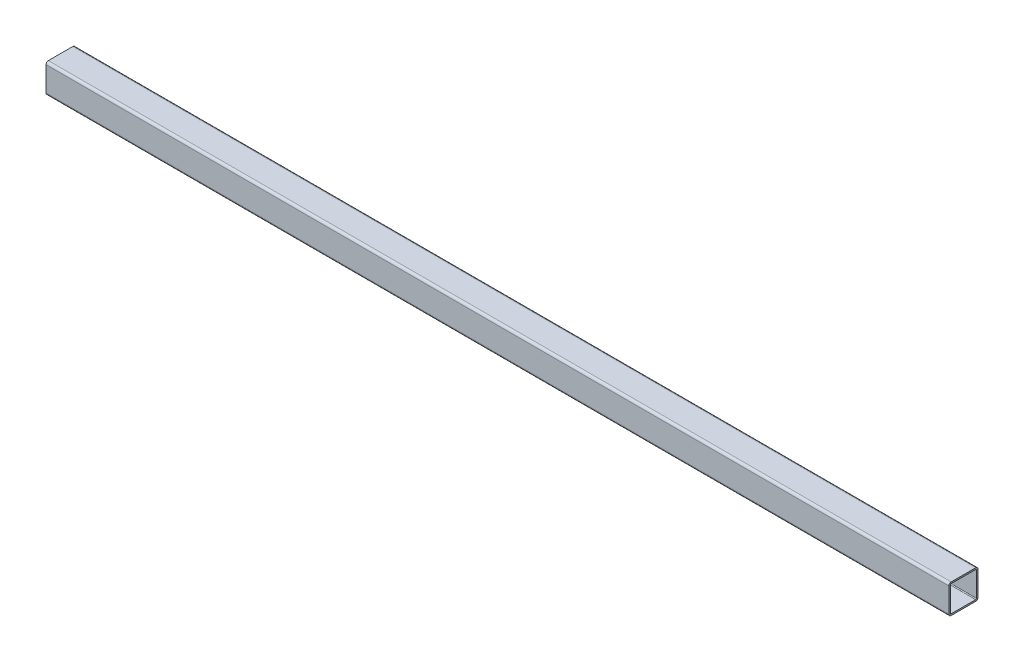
ISO-10303-21;
HEADER;
FILE_DESCRIPTION(('STEP AP214'),'2;1');
FILE_NAME('part.step','',(''),(''),'','','');
FILE_SCHEMA(('AUTOMOTIVE_DESIGN { 1 0 10303 214 1 1 1 1 }'));
ENDSEC;
DATA;
#1=APPLICATION_CONTEXT('core data for automotive mechanical design processes');
#2=APPLICATION_PROTOCOL_DEFINITION('international standard','automotive_design',2000,#1);
#3=PRODUCT_CONTEXT('',#1,'mechanical');
#4=PRODUCT('Part','Part','',(#3));
#5=PRODUCT_RELATED_PRODUCT_CATEGORY('part','',(#4));
#6=PRODUCT_DEFINITION_FORMATION('','',#4);
#7=PRODUCT_DEFINITION_CONTEXT('part definition',#1,'design');
#8=PRODUCT_DEFINITION('design','',#6,#7);
#9=PRODUCT_DEFINITION_SHAPE('','',#8);
#10=(LENGTH_UNIT() NAMED_UNIT(*) SI_UNIT(.MILLI.,.METRE.));
#11=(NAMED_UNIT(*) PLANE_ANGLE_UNIT() SI_UNIT($,.RADIAN.));
#12=(NAMED_UNIT(*) SI_UNIT($,.STERADIAN.) SOLID_ANGLE_UNIT());
#13=UNCERTAINTY_MEASURE_WITH_UNIT(LENGTH_MEASURE(1.E-05),#10,'distance_accuracy_value','');
#14=(GEOMETRIC_REPRESENTATION_CONTEXT(3) GLOBAL_UNCERTAINTY_ASSIGNED_CONTEXT((#13)) GLOBAL_UNIT_ASSIGNED_CONTEXT((#10,
#11,#12)) REPRESENTATION_CONTEXT('',''));
#15=CARTESIAN_POINT('',(0.,0.,0.));
#16=DIRECTION('',(0.,0.,1.));
#17=DIRECTION('',(1.,0.,0.));
#18=AXIS2_PLACEMENT_3D('',#15,#16,#17);
#19=CARTESIAN_POINT('',(393.7,10.541,21.209));
#20=DIRECTION('',(1.,0.,0.));
#21=DIRECTION('',(0.,0.,-1.));
#22=AXIS2_PLACEMENT_3D('',#19,#20,#21);
#23=PLANE('',#22);
#24=CARTESIAN_POINT('',(393.7,10.541,21.209));
#25=DIRECTION('',(1.,0.,0.));
#26=DIRECTION('',(0.,0.,-1.));
#27=AXIS2_PLACEMENT_3D('',#24,#25,#26);
#28=CIRCLE('',#27,1.01599999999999);
#29=CARTESIAN_POINT('',(393.7,10.541,22.225));
#30=VERTEX_POINT('',#29);
#31=CARTESIAN_POINT('',(393.7,9.525,21.209));
#32=VERTEX_POINT('',#31);
#33=EDGE_CURVE('E260',#30,#32,#28,.T.);
#34=ORIENTED_EDGE('',*,*,#33,.T.);
#35=DIRECTION('',(0.,0.,-1.));
#36=VECTOR('',#35,1.);
#37=CARTESIAN_POINT('',(393.7,9.525,21.209));
#38=LINE('',#37,#36);
#39=CARTESIAN_POINT('',(393.7,9.525,10.541));
#40=VERTEX_POINT('',#39);
#41=EDGE_CURVE('E474',#32,#40,#38,.T.);
#42=ORIENTED_EDGE('',*,*,#41,.T.);
#43=CARTESIAN_POINT('',(393.7,10.541,10.541));
#44=DIRECTION('',(1.,0.,0.));
#45=DIRECTION('',(0.,0.,-1.));
#46=AXIS2_PLACEMENT_3D('',#43,#44,#45);
#47=CIRCLE('',#46,1.016);
#48=CARTESIAN_POINT('',(393.7,10.541,9.525));
#49=VERTEX_POINT('',#48);
#50=EDGE_CURVE('E161',#40,#49,#47,.T.);
#51=ORIENTED_EDGE('',*,*,#50,.T.);
#52=DIRECTION('',(0.,1.,0.));
#53=VECTOR('',#52,1.);
#54=CARTESIAN_POINT('',(393.7,10.541,9.525));
#55=LINE('',#54,#53);
#56=CARTESIAN_POINT('',(393.7,21.209,9.525));
#57=VERTEX_POINT('',#56);
#58=EDGE_CURVE('E460',#49,#57,#55,.T.);
#59=ORIENTED_EDGE('',*,*,#58,.T.);
#60=CARTESIAN_POINT('',(393.7,21.209,10.541));
#61=DIRECTION('',(1.,0.,0.));
#62=DIRECTION('',(0.,0.,-1.));
#63=AXIS2_PLACEMENT_3D('',#60,#61,#62);
#64=CIRCLE('',#63,1.016);
#65=CARTESIAN_POINT('',(393.7,22.225,10.541));
#66=VERTEX_POINT('',#65);
#67=EDGE_CURVE('E469',#57,#66,#64,.T.);
#68=ORIENTED_EDGE('',*,*,#67,.T.);
#69=DIRECTION('',(0.,0.,1.));
#70=VECTOR('',#69,1.);
#71=CARTESIAN_POINT('',(393.7,22.225,10.541));
#72=LINE('',#71,#70);
#73=CARTESIAN_POINT('',(393.7,22.225,21.209));
#74=VERTEX_POINT('',#73);
#75=EDGE_CURVE('E276',#66,#74,#72,.T.);
#76=ORIENTED_EDGE('',*,*,#75,.T.);
#77=CARTESIAN_POINT('',(393.7,21.209,21.209));
#78=DIRECTION('',(1.,0.,0.));
#79=DIRECTION('',(0.,0.,-1.));
#80=AXIS2_PLACEMENT_3D('',#77,#78,#79);
#81=CIRCLE('',#80,1.016);
#82=CARTESIAN_POINT('',(393.7,21.209,22.225));
#83=VERTEX_POINT('',#82);
#84=EDGE_CURVE('E293',#74,#83,#81,.T.);
#85=ORIENTED_EDGE('',*,*,#84,.T.);
#86=DIRECTION('',(0.,-1.,0.));
#87=VECTOR('',#86,1.);
#88=CARTESIAN_POINT('',(393.7,21.209,22.225));
#89=LINE('',#88,#87);
#90=EDGE_CURVE('E257',#83,#30,#89,.T.);
#91=ORIENTED_EDGE('',*,*,#90,.T.);
#92=EDGE_LOOP('',(#34,#42,#51,#59,#68,#76,#85,#91));
#93=FACE_BOUND('',#92,.T.);
#94=DIRECTION('',(0.,1.,0.));
#95=VECTOR('',#94,1.);
#96=CARTESIAN_POINT('',(393.7,10.541,10.1854));
#97=LINE('',#96,#95);
#98=CARTESIAN_POINT('',(393.7,10.541,10.1854));
#99=VERTEX_POINT('',#98);
#100=CARTESIAN_POINT('',(393.7,21.209,10.1854));
#101=VERTEX_POINT('',#100);
#102=EDGE_CURVE('E253',#99,#101,#97,.T.);
#103=ORIENTED_EDGE('',*,*,#102,.F.);
#104=CARTESIAN_POINT('',(393.7,10.541,10.541));
#105=DIRECTION('',(1.,0.,0.));
#106=DIRECTION('',(0.,0.,-1.));
#107=AXIS2_PLACEMENT_3D('',#104,#105,#106);
#108=CIRCLE('',#107,0.355599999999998);
#109=CARTESIAN_POINT('',(393.7,10.1854,10.541));
#110=VERTEX_POINT('',#109);
#111=EDGE_CURVE('E100',#110,#99,#108,.T.);
#112=ORIENTED_EDGE('',*,*,#111,.F.);
#113=DIRECTION('',(0.,0.,-1.));
#114=VECTOR('',#113,1.);
#115=CARTESIAN_POINT('',(393.7,10.1854,21.209));
#116=LINE('',#115,#114);
#117=CARTESIAN_POINT('',(393.7,10.1854,21.209));
#118=VERTEX_POINT('',#117);
#119=EDGE_CURVE('E212',#118,#110,#116,.T.);
#120=ORIENTED_EDGE('',*,*,#119,.F.);
#121=CARTESIAN_POINT('',(393.7,10.541,21.209));
#122=DIRECTION('',(1.,0.,0.));
#123=DIRECTION('',(0.,0.,-1.));
#124=AXIS2_PLACEMENT_3D('',#121,#122,#123);
#125=CIRCLE('',#124,0.3556);
#126=CARTESIAN_POINT('',(393.7,10.541,21.5646));
#127=VERTEX_POINT('',#126);
#128=EDGE_CURVE('E243',#127,#118,#125,.T.);
#129=ORIENTED_EDGE('',*,*,#128,.F.);
#130=DIRECTION('',(0.,-1.,0.));
#131=VECTOR('',#130,1.);
#132=CARTESIAN_POINT('',(393.7,21.209,21.5646));
#133=LINE('',#132,#131);
#134=CARTESIAN_POINT('',(393.7,21.209,21.5646));
#135=VERTEX_POINT('',#134);
#136=EDGE_CURVE('E229',#135,#127,#133,.T.);
#137=ORIENTED_EDGE('',*,*,#136,.F.);
#138=CARTESIAN_POINT('',(393.7,21.209,21.209));
#139=DIRECTION('',(1.,0.,0.));
#140=DIRECTION('',(0.,0.,-1.));
#141=AXIS2_PLACEMENT_3D('',#138,#139,#140);
#142=CIRCLE('',#141,0.355600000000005);
#143=CARTESIAN_POINT('',(393.7,21.5646,21.209));
#144=VERTEX_POINT('',#143);
#145=EDGE_CURVE('E238',#144,#135,#142,.T.);
#146=ORIENTED_EDGE('',*,*,#145,.F.);
#147=DIRECTION('',(0.,0.,1.));
#148=VECTOR('',#147,1.);
#149=CARTESIAN_POINT('',(393.7,21.5646,10.541));
#150=LINE('',#149,#148);
#151=CARTESIAN_POINT('',(393.7,21.5646,10.541));
#152=VERTEX_POINT('',#151);
#153=EDGE_CURVE('E246',#152,#144,#150,.T.);
#154=ORIENTED_EDGE('',*,*,#153,.F.);
#155=CARTESIAN_POINT('',(393.7,21.209,10.541));
#156=DIRECTION('',(1.,2.66488927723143E-13,-2.66488927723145E-13));
#157=DIRECTION('',(-2.66488927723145E-13,0.,-1.));
#158=AXIS2_PLACEMENT_3D('',#155,#156,#157);
#159=CIRCLE('',#158,0.3556);
#160=EDGE_CURVE('E251',#101,#152,#159,.T.);
#161=ORIENTED_EDGE('',*,*,#160,.F.);
#162=EDGE_LOOP('',(#103,#112,#120,#129,#137,#146,#154,#161));
#163=FACE_BOUND('',#162,.T.);
#164=ADVANCED_FACE('F41',(#93,#163),#23,.T.);
#165=CARTESIAN_POINT('',(0.,10.541,21.209));
#166=DIRECTION('',(1.,0.,0.));
#167=DIRECTION('',(0.,0.,-1.));
#168=AXIS2_PLACEMENT_3D('',#165,#166,#167);
#169=PLANE('',#168);
#170=CARTESIAN_POINT('',(0.,10.541,21.209));
#171=DIRECTION('',(1.,0.,0.));
#172=DIRECTION('',(0.,0.,-1.));
#173=AXIS2_PLACEMENT_3D('',#170,#171,#172);
#174=CIRCLE('',#173,1.01599999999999);
#175=CARTESIAN_POINT('',(0.,10.541,22.225));
#176=VERTEX_POINT('',#175);
#177=CARTESIAN_POINT('',(0.,9.525,21.209));
#178=VERTEX_POINT('',#177);
#179=EDGE_CURVE('E154',#176,#178,#174,.T.);
#180=ORIENTED_EDGE('',*,*,#179,.F.);
#181=DIRECTION('',(0.,-1.,0.));
#182=VECTOR('',#181,1.);
#183=CARTESIAN_POINT('',(0.,21.209,22.225));
#184=LINE('',#183,#182);
#185=CARTESIAN_POINT('',(0.,21.209,22.225));
#186=VERTEX_POINT('',#185);
#187=EDGE_CURVE('E258',#186,#176,#184,.T.);
#188=ORIENTED_EDGE('',*,*,#187,.F.);
#189=CARTESIAN_POINT('',(0.,21.209,21.209));
#190=DIRECTION('',(1.,0.,0.));
#191=DIRECTION('',(0.,0.,-1.));
#192=AXIS2_PLACEMENT_3D('',#189,#190,#191);
#193=CIRCLE('',#192,1.016);
#194=CARTESIAN_POINT('',(0.,22.225,21.209));
#195=VERTEX_POINT('',#194);
#196=EDGE_CURVE('E261',#195,#186,#193,.T.);
#197=ORIENTED_EDGE('',*,*,#196,.F.);
#198=DIRECTION('',(0.,0.,1.));
#199=VECTOR('',#198,1.);
#200=CARTESIAN_POINT('',(0.,22.225,10.541));
#201=LINE('',#200,#199);
#202=CARTESIAN_POINT('',(0.,22.225,10.541));
#203=VERTEX_POINT('',#202);
#204=EDGE_CURVE('E263',#203,#195,#201,.T.);
#205=ORIENTED_EDGE('',*,*,#204,.F.);
#206=CARTESIAN_POINT('',(0.,21.209,10.541));
#207=DIRECTION('',(1.,0.,0.));
#208=DIRECTION('',(0.,0.,-1.));
#209=AXIS2_PLACEMENT_3D('',#206,#207,#208);
#210=CIRCLE('',#209,1.016);
#211=CARTESIAN_POINT('',(0.,21.209,9.525));
#212=VERTEX_POINT('',#211);
#213=EDGE_CURVE('E170',#212,#203,#210,.T.);
#214=ORIENTED_EDGE('',*,*,#213,.F.);
#215=DIRECTION('',(0.,1.,0.));
#216=VECTOR('',#215,1.);
#217=CARTESIAN_POINT('',(0.,10.541,9.525));
#218=LINE('',#217,#216);
#219=CARTESIAN_POINT('',(0.,10.541,9.525));
#220=VERTEX_POINT('',#219);
#221=EDGE_CURVE('E168',#220,#212,#218,.T.);
#222=ORIENTED_EDGE('',*,*,#221,.F.);
#223=CARTESIAN_POINT('',(0.,10.541,10.541));
#224=DIRECTION('',(1.,0.,0.));
#225=DIRECTION('',(0.,0.,-1.));
#226=AXIS2_PLACEMENT_3D('',#223,#224,#225);
#227=CIRCLE('',#226,1.016);
#228=CARTESIAN_POINT('',(0.,9.525,10.541));
#229=VERTEX_POINT('',#228);
#230=EDGE_CURVE('E153',#229,#220,#227,.T.);
#231=ORIENTED_EDGE('',*,*,#230,.F.);
#232=DIRECTION('',(0.,0.,-1.));
#233=VECTOR('',#232,1.);
#234=CARTESIAN_POINT('',(0.,9.525,21.209));
#235=LINE('',#234,#233);
#236=EDGE_CURVE('E143',#178,#229,#235,.T.);
#237=ORIENTED_EDGE('',*,*,#236,.F.);
#238=EDGE_LOOP('',(#180,#188,#197,#205,#214,#222,#231,#237));
#239=FACE_BOUND('',#238,.T.);
#240=CARTESIAN_POINT('',(0.,10.541,10.541));
#241=DIRECTION('',(1.,0.,0.));
#242=DIRECTION('',(0.,0.,-1.));
#243=AXIS2_PLACEMENT_3D('',#240,#241,#242);
#244=CIRCLE('',#243,0.355599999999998);
#245=CARTESIAN_POINT('',(0.,10.1854,10.541));
#246=VERTEX_POINT('',#245);
#247=CARTESIAN_POINT('',(0.,10.541,10.1854));
#248=VERTEX_POINT('',#247);
#249=EDGE_CURVE('E66',#246,#248,#244,.T.);
#250=ORIENTED_EDGE('',*,*,#249,.T.);
#251=DIRECTION('',(0.,1.,0.));
#252=VECTOR('',#251,1.);
#253=CARTESIAN_POINT('',(0.,10.541,10.1854));
#254=LINE('',#253,#252);
#255=CARTESIAN_POINT('',(0.,21.209,10.1854));
#256=VERTEX_POINT('',#255);
#257=EDGE_CURVE('E175',#248,#256,#254,.T.);
#258=ORIENTED_EDGE('',*,*,#257,.T.);
#259=CARTESIAN_POINT('',(0.,21.209,10.541));
#260=DIRECTION('',(1.,0.,0.));
#261=DIRECTION('',(0.,0.,-1.));
#262=AXIS2_PLACEMENT_3D('',#259,#260,#261);
#263=CIRCLE('',#262,0.3556);
#264=CARTESIAN_POINT('',(0.,21.5646,10.541));
#265=VERTEX_POINT('',#264);
#266=EDGE_CURVE('E178',#256,#265,#263,.T.);
#267=ORIENTED_EDGE('',*,*,#266,.T.);
#268=DIRECTION('',(0.,0.,1.));
#269=VECTOR('',#268,1.);
#270=CARTESIAN_POINT('',(0.,21.5646,10.541));
#271=LINE('',#270,#269);
#272=CARTESIAN_POINT('',(0.,21.5646,21.209));
#273=VERTEX_POINT('',#272);
#274=EDGE_CURVE('E181',#265,#273,#271,.T.);
#275=ORIENTED_EDGE('',*,*,#274,.T.);
#276=CARTESIAN_POINT('',(0.,21.209,21.209));
#277=DIRECTION('',(1.,0.,0.));
#278=DIRECTION('',(0.,0.,-1.));
#279=AXIS2_PLACEMENT_3D('',#276,#277,#278);
#280=CIRCLE('',#279,0.355600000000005);
#281=CARTESIAN_POINT('',(0.,21.209,21.5646));
#282=VERTEX_POINT('',#281);
#283=EDGE_CURVE('E184',#273,#282,#280,.T.);
#284=ORIENTED_EDGE('',*,*,#283,.T.);
#285=DIRECTION('',(0.,-1.,0.));
#286=VECTOR('',#285,1.);
#287=CARTESIAN_POINT('',(0.,21.209,21.5646));
#288=LINE('',#287,#286);
#289=CARTESIAN_POINT('',(0.,10.541,21.5646));
#290=VERTEX_POINT('',#289);
#291=EDGE_CURVE('E187',#282,#290,#288,.T.);
#292=ORIENTED_EDGE('',*,*,#291,.T.);
#293=CARTESIAN_POINT('',(0.,10.541,21.209));
#294=DIRECTION('',(1.,0.,0.));
#295=DIRECTION('',(0.,0.,-1.));
#296=AXIS2_PLACEMENT_3D('',#293,#294,#295);
#297=CIRCLE('',#296,0.3556);
#298=CARTESIAN_POINT('',(0.,10.1854,21.209));
#299=VERTEX_POINT('',#298);
#300=EDGE_CURVE('E190',#290,#299,#297,.T.);
#301=ORIENTED_EDGE('',*,*,#300,.T.);
#302=DIRECTION('',(0.,0.,-1.));
#303=VECTOR('',#302,1.);
#304=CARTESIAN_POINT('',(0.,10.1854,21.209));
#305=LINE('',#304,#303);
#306=EDGE_CURVE('E193',#299,#246,#305,.T.);
#307=ORIENTED_EDGE('',*,*,#306,.T.);
#308=EDGE_LOOP('',(#250,#258,#267,#275,#284,#292,#301,#307));
#309=FACE_BOUND('',#308,.T.);
#310=ADVANCED_FACE('F165',(#239,#309),#169,.F.);
#311=CARTESIAN_POINT('',(393.7,10.541,21.209));
#312=DIRECTION('',(-1.,0.,0.));
#313=DIRECTION('',(0.,-1.,0.));
#314=AXIS2_PLACEMENT_3D('',#311,#312,#313);
#315=CYLINDRICAL_SURFACE('',#314,1.016);
#316=ORIENTED_EDGE('',*,*,#179,.T.);
#317=DIRECTION('',(-1.,0.,0.));
#318=VECTOR('',#317,1.);
#319=CARTESIAN_POINT('',(393.7,9.525,21.209));
#320=LINE('',#319,#318);
#321=EDGE_CURVE('E11',#32,#178,#320,.T.);
#322=ORIENTED_EDGE('',*,*,#321,.F.);
#323=ORIENTED_EDGE('',*,*,#33,.F.);
#324=DIRECTION('',(-1.,0.,0.));
#325=VECTOR('',#324,1.);
#326=CARTESIAN_POINT('',(393.7,10.541,22.225));
#327=LINE('',#326,#325);
#328=EDGE_CURVE('E209',#30,#176,#327,.T.);
#329=ORIENTED_EDGE('',*,*,#328,.T.);
#330=EDGE_LOOP('',(#316,#322,#323,#329));
#331=FACE_BOUND('',#330,.T.);
#332=ADVANCED_FACE('F323',(#331),#315,.T.);
#333=CARTESIAN_POINT('',(393.7,9.525,21.209));
#334=DIRECTION('',(0.,1.,0.));
#335=DIRECTION('',(0.,0.,1.));
#336=AXIS2_PLACEMENT_3D('',#333,#334,#335);
#337=PLANE('',#336);
#338=ORIENTED_EDGE('',*,*,#236,.T.);
#339=DIRECTION('',(-1.,0.,0.));
#340=VECTOR('',#339,1.);
#341=CARTESIAN_POINT('',(393.7,9.525,10.541));
#342=LINE('',#341,#340);
#343=EDGE_CURVE('E50',#40,#229,#342,.T.);
#344=ORIENTED_EDGE('',*,*,#343,.F.);
#345=ORIENTED_EDGE('',*,*,#41,.F.);
#346=ORIENTED_EDGE('',*,*,#321,.T.);
#347=EDGE_LOOP('',(#338,#344,#345,#346));
#348=FACE_BOUND('',#347,.T.);
#349=ADVANCED_FACE('F147',(#348),#337,.F.);
#350=CARTESIAN_POINT('',(393.7,10.541,10.541));
#351=DIRECTION('',(-1.,0.,0.));
#352=DIRECTION('',(0.,-1.,0.));
#353=AXIS2_PLACEMENT_3D('',#350,#351,#352);
#354=CYLINDRICAL_SURFACE('',#353,1.016);
#355=ORIENTED_EDGE('',*,*,#230,.T.);
#356=DIRECTION('',(-1.,0.,0.));
#357=VECTOR('',#356,1.);
#358=CARTESIAN_POINT('',(393.7,10.541,9.525));
#359=LINE('',#358,#357);
#360=EDGE_CURVE('E162',#49,#220,#359,.T.);
#361=ORIENTED_EDGE('',*,*,#360,.F.);
#362=ORIENTED_EDGE('',*,*,#50,.F.);
#363=ORIENTED_EDGE('',*,*,#343,.T.);
#364=EDGE_LOOP('',(#355,#361,#362,#363));
#365=FACE_BOUND('',#364,.T.);
#366=ADVANCED_FACE('F157',(#365),#354,.T.);
#367=CARTESIAN_POINT('',(393.7,10.541,9.525));
#368=DIRECTION('',(0.,0.,1.));
#369=DIRECTION('',(1.,0.,0.));
#370=AXIS2_PLACEMENT_3D('',#367,#368,#369);
#371=PLANE('',#370);
#372=ORIENTED_EDGE('',*,*,#221,.T.);
#373=DIRECTION('',(-1.,0.,0.));
#374=VECTOR('',#373,1.);
#375=CARTESIAN_POINT('',(393.7,21.209,9.525));
#376=LINE('',#375,#374);
#377=EDGE_CURVE('E197',#57,#212,#376,.T.);
#378=ORIENTED_EDGE('',*,*,#377,.F.);
#379=ORIENTED_EDGE('',*,*,#58,.F.);
#380=ORIENTED_EDGE('',*,*,#360,.T.);
#381=EDGE_LOOP('',(#372,#378,#379,#380));
#382=FACE_BOUND('',#381,.T.);
#383=ADVANCED_FACE('F333',(#382),#371,.F.);
#384=CARTESIAN_POINT('',(393.7,21.209,10.541));
#385=DIRECTION('',(-1.,0.,0.));
#386=DIRECTION('',(0.,-1.,0.));
#387=AXIS2_PLACEMENT_3D('',#384,#385,#386);
#388=CYLINDRICAL_SURFACE('',#387,1.016);
#389=ORIENTED_EDGE('',*,*,#213,.T.);
#390=DIRECTION('',(-1.,0.,0.));
#391=VECTOR('',#390,1.);
#392=CARTESIAN_POINT('',(393.7,22.225,10.541));
#393=LINE('',#392,#391);
#394=EDGE_CURVE('E200',#66,#203,#393,.T.);
#395=ORIENTED_EDGE('',*,*,#394,.F.);
#396=ORIENTED_EDGE('',*,*,#67,.F.);
#397=ORIENTED_EDGE('',*,*,#377,.T.);
#398=EDGE_LOOP('',(#389,#395,#396,#397));
#399=FACE_BOUND('',#398,.T.);
#400=ADVANCED_FACE('F266',(#399),#388,.T.);
#401=CARTESIAN_POINT('',(393.7,22.225,10.541));
#402=DIRECTION('',(0.,-1.,0.));
#403=DIRECTION('',(0.,0.,-1.));
#404=AXIS2_PLACEMENT_3D('',#401,#402,#403);
#405=PLANE('',#404);
#406=ORIENTED_EDGE('',*,*,#204,.T.);
#407=DIRECTION('',(-1.,0.,0.));
#408=VECTOR('',#407,1.);
#409=CARTESIAN_POINT('',(393.7,22.225,21.209));
#410=LINE('',#409,#408);
#411=EDGE_CURVE('E203',#74,#195,#410,.T.);
#412=ORIENTED_EDGE('',*,*,#411,.F.);
#413=ORIENTED_EDGE('',*,*,#75,.F.);
#414=ORIENTED_EDGE('',*,*,#394,.T.);
#415=EDGE_LOOP('',(#406,#412,#413,#414));
#416=FACE_BOUND('',#415,.T.);
#417=ADVANCED_FACE('F273',(#416),#405,.F.);
#418=CARTESIAN_POINT('',(393.7,21.209,21.209));
#419=DIRECTION('',(-1.,0.,0.));
#420=DIRECTION('',(0.,-1.,0.));
#421=AXIS2_PLACEMENT_3D('',#418,#419,#420);
#422=CYLINDRICAL_SURFACE('',#421,1.016);
#423=ORIENTED_EDGE('',*,*,#196,.T.);
#424=DIRECTION('',(-1.,0.,0.));
#425=VECTOR('',#424,1.);
#426=CARTESIAN_POINT('',(393.7,21.209,22.225));
#427=LINE('',#426,#425);
#428=EDGE_CURVE('E206',#83,#186,#427,.T.);
#429=ORIENTED_EDGE('',*,*,#428,.F.);
#430=ORIENTED_EDGE('',*,*,#84,.F.);
#431=ORIENTED_EDGE('',*,*,#411,.T.);
#432=EDGE_LOOP('',(#423,#429,#430,#431));
#433=FACE_BOUND('',#432,.T.);
#434=ADVANCED_FACE('F281',(#433),#422,.T.);
#435=CARTESIAN_POINT('',(393.7,21.209,22.225));
#436=DIRECTION('',(0.,0.,-1.));
#437=DIRECTION('',(0.,1.,0.));
#438=AXIS2_PLACEMENT_3D('',#435,#436,#437);
#439=PLANE('',#438);
#440=ORIENTED_EDGE('',*,*,#187,.T.);
#441=ORIENTED_EDGE('',*,*,#328,.F.);
#442=ORIENTED_EDGE('',*,*,#90,.F.);
#443=ORIENTED_EDGE('',*,*,#428,.T.);
#444=EDGE_LOOP('',(#440,#441,#442,#443));
#445=FACE_BOUND('',#444,.T.);
#446=ADVANCED_FACE('F285',(#445),#439,.F.);
#447=CARTESIAN_POINT('',(393.7,10.541,10.541));
#448=DIRECTION('',(-1.,0.,0.));
#449=DIRECTION('',(0.,-1.,0.));
#450=AXIS2_PLACEMENT_3D('',#447,#448,#449);
#451=CYLINDRICAL_SURFACE('',#450,0.3556);
#452=ORIENTED_EDGE('',*,*,#249,.F.);
#453=DIRECTION('',(-1.,0.,0.));
#454=VECTOR('',#453,1.);
#455=CARTESIAN_POINT('',(393.7,10.1854,10.541));
#456=LINE('',#455,#454);
#457=EDGE_CURVE('E210',#110,#246,#456,.T.);
#458=ORIENTED_EDGE('',*,*,#457,.F.);
#459=ORIENTED_EDGE('',*,*,#111,.T.);
#460=DIRECTION('',(-1.,0.,0.));
#461=VECTOR('',#460,1.);
#462=CARTESIAN_POINT('',(393.7,10.541,10.1854));
#463=LINE('',#462,#461);
#464=EDGE_CURVE('E213',#99,#248,#463,.T.);
#465=ORIENTED_EDGE('',*,*,#464,.T.);
#466=EDGE_LOOP('',(#452,#458,#459,#465));
#467=FACE_BOUND('',#466,.T.);
#468=ADVANCED_FACE('F299',(#467),#451,.F.);
#469=CARTESIAN_POINT('',(393.7,10.541,10.1854));
#470=DIRECTION('',(0.,0.,1.));
#471=DIRECTION('',(1.,0.,0.));
#472=AXIS2_PLACEMENT_3D('',#469,#470,#471);
#473=PLANE('',#472);
#474=ORIENTED_EDGE('',*,*,#257,.F.);
#475=ORIENTED_EDGE('',*,*,#464,.F.);
#476=ORIENTED_EDGE('',*,*,#102,.T.);
#477=DIRECTION('',(-1.,0.,0.));
#478=VECTOR('',#477,1.);
#479=CARTESIAN_POINT('',(393.7,21.209,10.1854));
#480=LINE('',#479,#478);
#481=EDGE_CURVE('E215',#101,#256,#480,.T.);
#482=ORIENTED_EDGE('',*,*,#481,.T.);
#483=EDGE_LOOP('',(#474,#475,#476,#482));
#484=FACE_BOUND('',#483,.T.);
#485=ADVANCED_FACE('F303',(#484),#473,.T.);
#486=CARTESIAN_POINT('',(393.7,21.209,10.541));
#487=DIRECTION('',(-1.,0.,0.));
#488=DIRECTION('',(0.,-1.,0.));
#489=AXIS2_PLACEMENT_3D('',#486,#487,#488);
#490=CYLINDRICAL_SURFACE('',#489,0.3556);
#491=ORIENTED_EDGE('',*,*,#266,.F.);
#492=ORIENTED_EDGE('',*,*,#481,.F.);
#493=ORIENTED_EDGE('',*,*,#160,.T.);
#494=DIRECTION('',(-1.,0.,0.));
#495=VECTOR('',#494,1.);
#496=CARTESIAN_POINT('',(393.7,21.5646,10.541));
#497=LINE('',#496,#495);
#498=EDGE_CURVE('E217',#152,#265,#497,.T.);
#499=ORIENTED_EDGE('',*,*,#498,.T.);
#500=EDGE_LOOP('',(#491,#492,#493,#499));
#501=FACE_BOUND('',#500,.T.);
#502=ADVANCED_FACE('F306',(#501),#490,.F.);
#503=CARTESIAN_POINT('',(393.7,21.5646,10.541));
#504=DIRECTION('',(0.,-1.,0.));
#505=DIRECTION('',(0.,0.,-1.));
#506=AXIS2_PLACEMENT_3D('',#503,#504,#505);
#507=PLANE('',#506);
#508=ORIENTED_EDGE('',*,*,#274,.F.);
#509=ORIENTED_EDGE('',*,*,#498,.F.);
#510=ORIENTED_EDGE('',*,*,#153,.T.);
#511=DIRECTION('',(-1.,0.,0.));
#512=VECTOR('',#511,1.);
#513=CARTESIAN_POINT('',(393.7,21.5646,21.209));
#514=LINE('',#513,#512);
#515=EDGE_CURVE('E219',#144,#273,#514,.T.);
#516=ORIENTED_EDGE('',*,*,#515,.T.);
#517=EDGE_LOOP('',(#508,#509,#510,#516));
#518=FACE_BOUND('',#517,.T.);
#519=ADVANCED_FACE('F309',(#518),#507,.T.);
#520=CARTESIAN_POINT('',(393.7,21.209,21.209));
#521=DIRECTION('',(-1.,0.,0.));
#522=DIRECTION('',(0.,-1.,0.));
#523=AXIS2_PLACEMENT_3D('',#520,#521,#522);
#524=CYLINDRICAL_SURFACE('',#523,0.355600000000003);
#525=ORIENTED_EDGE('',*,*,#283,.F.);
#526=ORIENTED_EDGE('',*,*,#515,.F.);
#527=ORIENTED_EDGE('',*,*,#145,.T.);
#528=DIRECTION('',(-1.,0.,0.));
#529=VECTOR('',#528,1.);
#530=CARTESIAN_POINT('',(393.7,21.209,21.5646));
#531=LINE('',#530,#529);
#532=EDGE_CURVE('E221',#135,#282,#531,.T.);
#533=ORIENTED_EDGE('',*,*,#532,.T.);
#534=EDGE_LOOP('',(#525,#526,#527,#533));
#535=FACE_BOUND('',#534,.T.);
#536=ADVANCED_FACE('F236',(#535),#524,.F.);
#537=CARTESIAN_POINT('',(393.7,21.209,21.5646));
#538=DIRECTION('',(0.,0.,-1.));
#539=DIRECTION('',(-1.,0.,0.));
#540=AXIS2_PLACEMENT_3D('',#537,#538,#539);
#541=PLANE('',#540);
#542=ORIENTED_EDGE('',*,*,#291,.F.);
#543=ORIENTED_EDGE('',*,*,#532,.F.);
#544=ORIENTED_EDGE('',*,*,#136,.T.);
#545=DIRECTION('',(-1.,0.,0.));
#546=VECTOR('',#545,1.);
#547=CARTESIAN_POINT('',(393.7,10.541,21.5646));
#548=LINE('',#547,#546);
#549=EDGE_CURVE('E222',#127,#290,#548,.T.);
#550=ORIENTED_EDGE('',*,*,#549,.T.);
#551=EDGE_LOOP('',(#542,#543,#544,#550));
#552=FACE_BOUND('',#551,.T.);
#553=ADVANCED_FACE('F226',(#552),#541,.T.);
#554=CARTESIAN_POINT('',(393.7,10.541,21.209));
#555=DIRECTION('',(-1.,0.,0.));
#556=DIRECTION('',(0.,-1.,0.));
#557=AXIS2_PLACEMENT_3D('',#554,#555,#556);
#558=CYLINDRICAL_SURFACE('',#557,0.355600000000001);
#559=ORIENTED_EDGE('',*,*,#300,.F.);
#560=ORIENTED_EDGE('',*,*,#549,.F.);
#561=ORIENTED_EDGE('',*,*,#128,.T.);
#562=DIRECTION('',(-1.,0.,0.));
#563=VECTOR('',#562,1.);
#564=CARTESIAN_POINT('',(393.7,10.1854,21.209));
#565=LINE('',#564,#563);
#566=EDGE_CURVE('E45',#118,#299,#565,.T.);
#567=ORIENTED_EDGE('',*,*,#566,.T.);
#568=EDGE_LOOP('',(#559,#560,#561,#567));
#569=FACE_BOUND('',#568,.T.);
#570=ADVANCED_FACE('F231',(#569),#558,.F.);
#571=CARTESIAN_POINT('',(393.7,10.1854,21.209));
#572=DIRECTION('',(0.,1.,0.));
#573=DIRECTION('',(0.,0.,1.));
#574=AXIS2_PLACEMENT_3D('',#571,#572,#573);
#575=PLANE('',#574);
#576=ORIENTED_EDGE('',*,*,#306,.F.);
#577=ORIENTED_EDGE('',*,*,#566,.F.);
#578=ORIENTED_EDGE('',*,*,#119,.T.);
#579=ORIENTED_EDGE('',*,*,#457,.T.);
#580=EDGE_LOOP('',(#576,#577,#578,#579));
#581=FACE_BOUND('',#580,.T.);
#582=ADVANCED_FACE('F43',(#581),#575,.T.);
#583=CLOSED_SHELL('',(#164,#310,#332,#349,#366,#383,#400,#417,#434,#446,#468,#485,#502,#519,
#536,#553,#570,#582));
#584=MANIFOLD_SOLID_BREP('B2',#583);
#585=ADVANCED_BREP_SHAPE_REPRESENTATION('',(#18,#584),#14);
#586=SHAPE_DEFINITION_REPRESENTATION(#9,#585);
ENDSEC;
END-ISO-10303-21;
